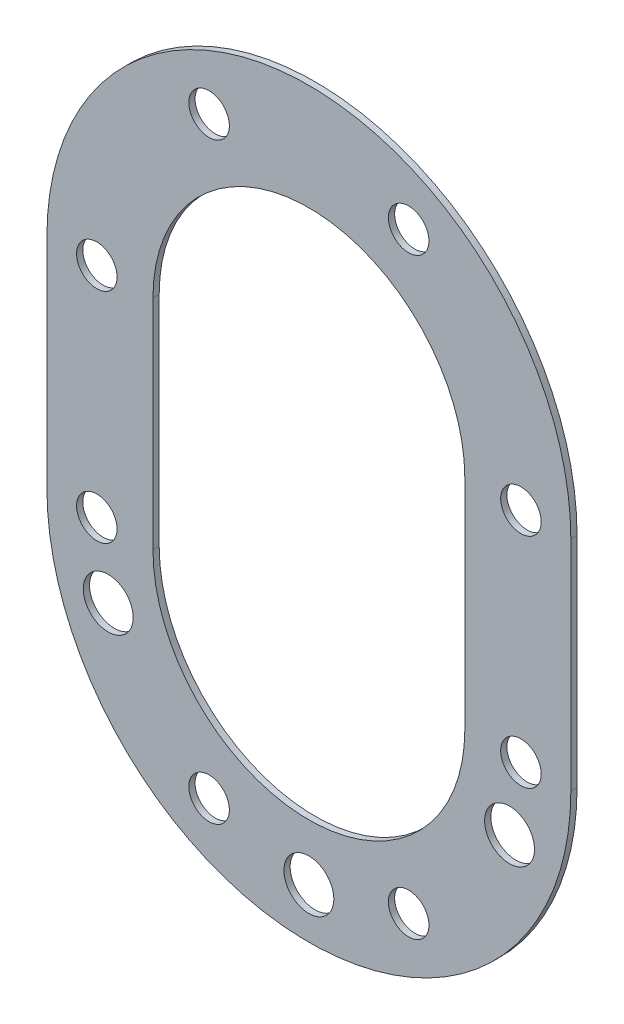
from build123d import *

# Parameters (mm, degrees)
EXTRUDE_1_DEPTH     = 1
CUT_EXTRUDE_1_DEPTH = 88.715449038
SKETCH_10_R         = 3.25
CUT_EXTRUDE_2_DEPTH = 88.715449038
SKETCH_11_R         = 4
CUT_EXTRUDE_3_DEPTH = 88.715449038


with BuildPart() as part:
    # Sketch 7 → Extrude 1 (new body)
    with BuildSketch(Plane.XY):
        with BuildLine():
            Line((-42, 0), (-42, -35))
            ThreePointArc((-42, -35), (0, -77), (42, -35))
            Line((42, -35), (42, 0))
            ThreePointArc((42, 0), (0, 42), (-42, 0))
        make_face()
    extrude(amount=EXTRUDE_1_DEPTH)

    # Sketch 8 → Cut-Extrude 1 (cut, through all)
    with BuildSketch(Plane.XY):
        with BuildLine():
            Line((-25, 0), (-25, -35))
            ThreePointArc((-25, -35), (0, -60), (25, -35))
            Line((25, -35), (25, 0))
            ThreePointArc((25, 0), (0, 25), (-25, 0))
        make_face()
    extrude(amount=CUT_EXTRUDE_1_DEPTH, mode=Mode.SUBTRACT)

    # Sketch 10 → Cut-Extrude 2 (cut, through all)
    with BuildSketch(Plane.XY):
        with Locations((-16, 30)):
            Circle(SKETCH_10_R)
    cut_extrude_2 = extrude(amount=CUT_EXTRUDE_2_DEPTH, mode=Mode.SUBTRACT)

    # Pattern Sketch 1: Cut-Extrude 2 at 7 more places
    with Locations((32, 0, 0), (32, -95, 0), (0, -95, 0), (-18, -65, 0), (-18, -30, 0), (50, -30, 0), (50, -65, 0)):
        add(cut_extrude_2, mode=Mode.SUBTRACT)

    # Sketch 11 → Cut-Extrude 3 (cut, through all)
    with BuildSketch(Plane.XY):
        with Locations((-32.171415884, -46)):
            Circle(SKETCH_11_R)
        with Locations((0, -69)):
            Circle(SKETCH_11_R)
        with Locations((32.171415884, -46)):
            Circle(SKETCH_11_R)
    extrude(amount=CUT_EXTRUDE_3_DEPTH, mode=Mode.SUBTRACT)


solid = part.part
